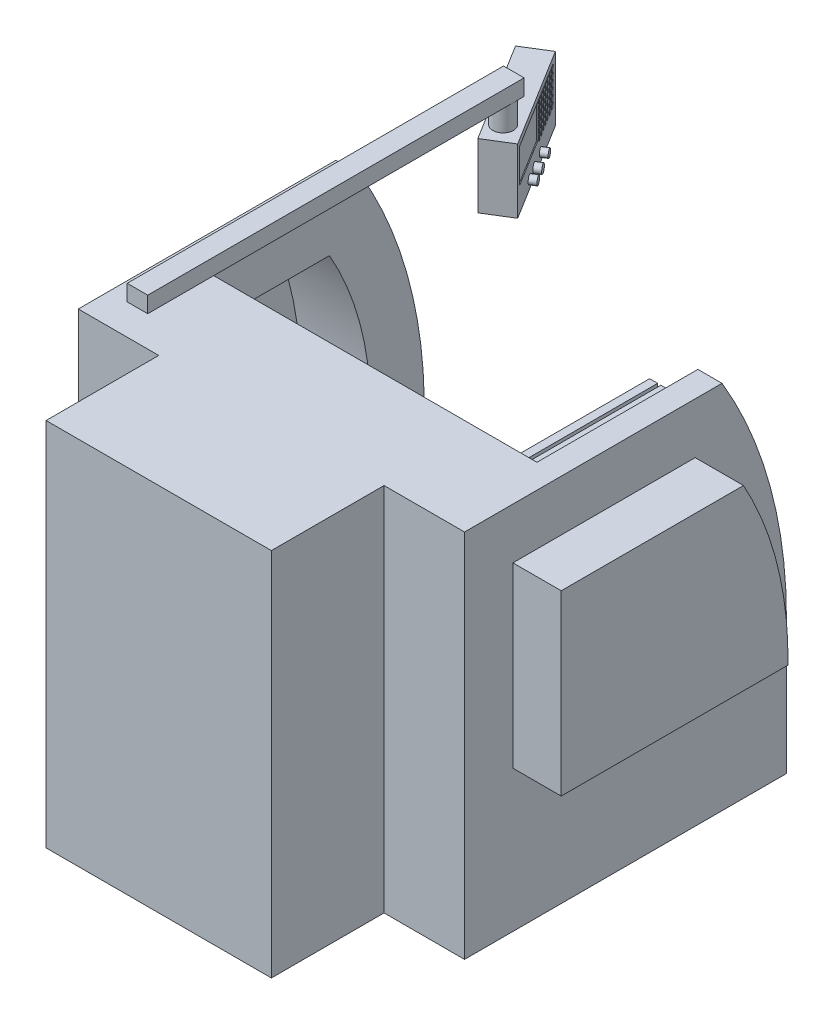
from build123d import *

# Parameters (mm, degrees)
EXTRUDE1_DEPTH       = 1200
SKETCH2_W            = 1400
SKETCH2_H            = 2000
EXTRUDE2_DEPTH       = 700
SKETCH3_W            = 2100
SKETCH3_H            = 1508.016916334
EXTRUDE3_DEPTH       = 1400
SKETCH7_R            = 93.758444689
EXTRUDE5_DEPTH       = 180
SKETCH8_R            = 58.863893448
EXTRUDE6_DEPTH       = 180
SKETCH9_R            = 74.427500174
EXTRUDE7_DEPTH       = 40
EXTRUDE7_DRAFT       = -20
EXTRUDE8_DEPTH       = 100
CIRPATTERN1_COUNT    = 28
SKETCH11_W           = 300
SKETCH11_H           = 1400
EXTRUDE10_DEPTH      = 50
SKETCH12_W           = 600
SKETCH12_H           = 1500
EXTRUDE11_DEPTH      = 100
EXTRUDE12_REACH      = 5276.941
LPATTERN1_COUNT      = 5
LPATTERN1_PITCH      = 120
EXTRUDE17_DEPTH      = 300
EXTRUDE18_DEPTH      = 440
EXTRUDE19_DEPTH      = 400
SKETCH22_W           = 127.705706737
SKETCH22_H           = 2338.616492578
EXTRUDE22_DEPTH      = 100
SKETCH23_R           = 63.852853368
EXTRUDE23_DEPTH      = 150
EXTRUDE24_DEPTH      = 400
SKETCH25_W           = 350.7399512
SKETCH25_H           = 210.727414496
EXTRUDE25_DEPTH      = 5
SKETCH26_W           = 30.480321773
SKETCH26_H           = 23.73547811
EXTRUDE26_DEPTH      = 3
LPATTERN4_COUNT      = 7
LPATTERN4_PITCH      = 40
LPATTERN4_COUNT_DIR2 = 6
LPATTERN4_PITCH_DIR2 = 40
SKETCH27_R           = 25.189393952
SKETCH27_R_2         = 26.805855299
SKETCH27_R_3         = 23.863126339
EXTRUDE27_DEPTH      = 40
BOSS_EXTRU_1_DEPTH   = 300
ESQUISSE2_W          = 610.539209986
ESQUISSE2_H          = 900
BOSS_EXTRU_2_DEPTH   = 555


with BuildPart() as part:
    # Sketch1 → Extrude1 (new, symmetric)
    with BuildSketch(Plane(origin=(0, 0, 0), x_dir=(0, 0, -1), z_dir=(1, 0, 0))):
        with BuildLine():
            Line((0, 0), (2000, 0))
            Line((2000, 0), (2000, 543.290023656))
            ThreePointArc((2000, 543.290023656), (1898.182873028, 1298.605182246), (1600, 2000))
            Line((1600, 2000), (0, 2000))
            Line((0, 2000), (0, 0))
        make_face()
    extrude(amount=EXTRUDE1_DEPTH, both=True)

    # Sketch2 → Extrude2 (add)
    with BuildSketch(Plane.XY):
        with Locations((0, 1000)):
            Rectangle(SKETCH2_W, SKETCH2_H)
    extrude(amount=EXTRUDE2_DEPTH)

    # Sketch3 → Extrude3 (cut)
    with BuildSketch(Plane(origin=(0, 2000, 0), x_dir=(1, 0, 0), z_dir=(0, 1, 0))):
        with Locations((0, 1354.008458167)):
            Rectangle(SKETCH3_W, SKETCH3_H)
    extrude(amount=-EXTRUDE3_DEPTH, mode=Mode.SUBTRACT)

    # Sketch7 → Extrude5 (add)
    with BuildSketch(Plane(origin=(0, 900, -600), x_dir=(1, 0, 0), z_dir=(0, 0, -1))):
        with Locations((0, -311.912714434)):
            Circle(SKETCH7_R)
    extrude(amount=EXTRUDE5_DEPTH)

    # Sketch8 → Extrude6 (add)
    with BuildSketch(Plane(origin=(0, 0, -780), x_dir=(1, 0, 0), z_dir=(0, 0, -1))):
        with Locations(Location((0, -1211.912714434, 0), (0, 0, 90))):
            Circle(SKETCH8_R)
    extrude(amount=EXTRUDE6_DEPTH)


with BuildPart() as extrude7_tool:
    # Sketch9 → Extrude7 (with draft: the straight prism first)
    with BuildSketch(Plane(origin=(0, 0, -960), x_dir=(1, 0, 0), z_dir=(0, 0, -1))):
        with Locations((0, -1211.912714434)):
            Circle(SKETCH9_R)
    extrude(amount=EXTRUDE7_DEPTH)
    # Extrude7: the draft: its side faces are tilted about the plane it starts from
    extrude7_sides = [extrude7_tool.faces().sort_by_distance(p)[0] for p in [
        (-74.427500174, 1211.912714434, -980),
    ]]
    draft(extrude7_sides, Plane(origin=(0, 0, -960), x_dir=(1, 0, 0), z_dir=(0, 0, -1)), EXTRUDE7_DRAFT)


with BuildPart() as part_1:
    add(part.part)

    # Extrude7: add extrude7_tool
    add(extrude7_tool.part)

    # Sketch10 → Extrude8 (cut)
    with BuildSketch(Plane.XY.offset(-960)):
        Polygon((-261.305541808, 1353.135181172), (-216.841140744, 1391.596325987), (-63.589133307, 1244.416205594), align=None)
    extrude8 = extrude(amount=-EXTRUDE8_DEPTH, mode=Mode.SUBTRACT)

    # CirPattern1: Extrude8 ×28 about axis
    cirpattern1_axis = Axis((0, 1211.912714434, 0), (0, 0, 1))
    for i in range(1, CIRPATTERN1_COUNT):
        add(extrude8.rotate(cirpattern1_axis, i * 360 / CIRPATTERN1_COUNT), mode=Mode.SUBTRACT)

    # Sketch11 → Extrude10 (add)
    with BuildSketch(Plane(origin=(0, 600, 0), x_dir=(1, 0, 0), z_dir=(0, 1, 0))):
        with Locations((0, 1855)):
            Rectangle(SKETCH11_W, SKETCH11_H)
    extrude(amount=EXTRUDE10_DEPTH)

    # Sketch12 → Extrude11 (add)
    with BuildSketch(Plane(origin=(0, 650, 0), x_dir=(1, 0, 0), z_dir=(0, 1, 0))):
        with Locations((0, 1900)):
            Rectangle(SKETCH12_W, SKETCH12_H)
    extrude(amount=EXTRUDE11_DEPTH)

    # Sketch13 → Extrude12 (cut, up to next)
    with BuildSketch(Plane(origin=(2350, 0, -2650), x_dir=(1, 0, 0), z_dir=(0, 0, 1)), mode=Mode.PRIVATE) as extrude12_sk1:
        Polygon((-2120, 750), (-2100, 750), (-2100, 725), (-2080, 725), (-2080, 710), (-2140, 710), (-2140, 725), (-2120, 725), align=None)
    extrude12_tool1 = extrude(extrude12_sk1.sketch, amount=EXTRUDE12_REACH, mode=Mode.PRIVATE) & part_1.part
    extrude12 = extrude12_tool1.solids().sort_by_distance((240, 724.642857, -2650))[0]
    add(extrude12, mode=Mode.SUBTRACT)

    # LPattern1: Extrude12 ×5
    with Locations(*[(-i * LPATTERN1_PITCH, 0, 0) for i in range(1, LPATTERN1_COUNT)]):
        add(extrude12, mode=Mode.SUBTRACT)

    # Sketch17 → Extrude17 (add)
    with BuildSketch(Plane.ZY.offset(1200)):
        with BuildLine():
            Line((-1433.264840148, 1683.43010119), (-300.786186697, 1683.43010119))
            Line((-300.786186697, 1683.43010119), (-300.786186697, 578.572878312))
            Line((-300.786186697, 578.572878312), (-1709.479145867, 578.572878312))
            ThreePointArc((-1709.479145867, 578.572878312), (-1644.194518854, 1149.207121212), (-1433.264840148, 1683.43010119))
        make_face()
    extrude17 = extrude(amount=EXTRUDE17_DEPTH)

    # Sketch18 → Extrude18 (cut)
    with BuildSketch(Plane(origin=(-1050, 0, 0), x_dir=(0, 0, -1), z_dir=(1, 0, 0))):
        with BuildLine():
            Line((334.342052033, 1656.604769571), (334.342052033, 599.169202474))
            Line((334.342052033, 599.169202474), (1663.611955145, 599.169202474))
            ThreePointArc((1663.611955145, 599.169202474), (1613.10156658, 1146.03096989), (1410.806022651, 1656.604769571))
            Line((1410.806022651, 1656.604769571), (334.342052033, 1656.604769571))
        make_face()
    extrude18 = extrude(amount=-EXTRUDE18_DEPTH, mode=Mode.SUBTRACT)

    # Sketch19 → Extrude19 (cut)
    with BuildSketch(Plane(origin=(0, 600, 0), x_dir=(1, 0, 0), z_dir=(0, 1, 0))):
        Polygon((-150, 1865.404061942), (-1050, 1865.404061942), (-1050, 1663.653737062), (-1050, 600), (1050, 600), (1050, 1865.404061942), (150, 1865.404061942), (150, 1679.430378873), (710.913508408, 1679.430378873), (710.913508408, 1034.727052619), (-747.806657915, 1034.727052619), (-747.806657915, 1679.430378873), (-150, 1679.430378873), align=None)
    extrude19 = extrude(amount=-EXTRUDE19_DEPTH, mode=Mode.SUBTRACT)

    # Mirror2: Extrude17, Extrude18, Extrude19 across plane
    add(extrude17.mirror(Plane(origin=(0, 0, 0), x_dir=(0, 0, 1), z_dir=(1, 0, 0))))
    add(extrude18.mirror(Plane(origin=(0, 0, 0), x_dir=(0, 0, 1), z_dir=(1, 0, 0))), mode=Mode.SUBTRACT)
    add(extrude19.mirror(Plane(origin=(0, 0, 0), x_dir=(0, 0, 1), z_dir=(1, 0, 0))), mode=Mode.SUBTRACT)

    # Sketch22 → Extrude22 (add)
    with BuildSketch(Plane(origin=(0, 2000, 0), x_dir=(1, 0, 0), z_dir=(0, 1, 0))):
        with Locations((-1022.402708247, 1359.474828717)):
            Rectangle(SKETCH22_W, SKETCH22_H)
    extrude(amount=EXTRUDE22_DEPTH)

    # Sketch23 → Extrude23 (add)
    with BuildSketch(Plane.XZ.offset(-2000)):
        with Locations(Location((-1022.402708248, -2462.270106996, 0), (0, 0, 180))):
            Circle(SKETCH23_R)
    extrude(amount=EXTRUDE23_DEPTH)

    # Sketch24 → Extrude24 (add)
    with BuildSketch(Plane.XZ.offset(-1850)):
        Polygon((-1406.701367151, -2923.495090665), (-1253.661441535, -3018.251521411), (-872.849554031, -2403.207006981), (-1025.889479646, -2308.450576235), align=None)
    extrude(amount=EXTRUDE24_DEPTH)

    # Sketch25 → Extrude25 (cut)
    with BuildSketch(Plane(origin=(444.65886188, 0, -275.315650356), x_dir=(-0.5264246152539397, 0, -0.8502218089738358), z_dir=(0.8502218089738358, 0, -0.5264246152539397))):
        with Locations((2712.759231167, 1706.772986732)):
            Rectangle(SKETCH25_W, SKETCH25_H)
    extrude(amount=-EXTRUDE25_DEPTH, mode=Mode.SUBTRACT)

    # Sketch26 → Extrude26 (add)
    with BuildSketch(Plane(origin=(444.65886188, 0, -275.315650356), x_dir=(-0.5264246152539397, 0, -0.8502218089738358), z_dir=(0.8502218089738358, 0, -0.5264246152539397))):
        with Locations((2920.612545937, 1801.558074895)):
            Rectangle(SKETCH26_W, SKETCH26_H)
    extrude26 = extrude(amount=EXTRUDE26_DEPTH)

    # LPattern4: Extrude26 7 × 6
    with Locations(*[Vector(-0.5264246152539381, 0, -0.8502218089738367) * (i * LPATTERN4_PITCH) + Vector(0, -1, 0) * (j * LPATTERN4_PITCH_DIR2) for i in range(LPATTERN4_COUNT) for j in range(LPATTERN4_COUNT_DIR2) if (i, j) != (0, 0)]):
        add(extrude26)

    # Sketch27 → Extrude27 (add)
    with BuildSketch(Plane(origin=(444.65886188, 0, -275.315650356), x_dir=(-0.5264246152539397, 0, -0.8502218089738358), z_dir=(0.8502218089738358, 0, -0.5264246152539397))):
        with Locations(Location((2727.800635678, 1505.797640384, 0), (0, 0, 180))):
            Circle(SKETCH27_R)
        with Locations(Location((2818.95300851, 1505.797640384, 0), (0, 0, 180))):
            Circle(SKETCH27_R_2)
        with Locations(Location((2940.782721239, 1505.797640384, 0), (0, 0, 180))):
            Circle(SKETCH27_R_3)
    extrude(amount=EXTRUDE27_DEPTH)

    # Esquisse1 → Boss.-Extru.1 (add)
    with BuildSketch(Plane.XZ):
        Polygon((-1200, 0), (-1200, -2000), (1200, -2000), (1200, 0), (700, 0), (700, 700), (-700, 700), (-700, 0), align=None)
    extrude(amount=BOSS_EXTRU_1_DEPTH)

    # Esquisse2 → Boss.-Extru.2 (add)
    with BuildSketch(Plane(origin=(0, 0, -2000), x_dir=(-1, 0, 0), z_dir=(0, 0, -1))):
        with Locations((0, 150)):
            Rectangle(ESQUISSE2_W, ESQUISSE2_H)
    extrude(amount=BOSS_EXTRU_2_DEPTH)


solid = part_1.part
